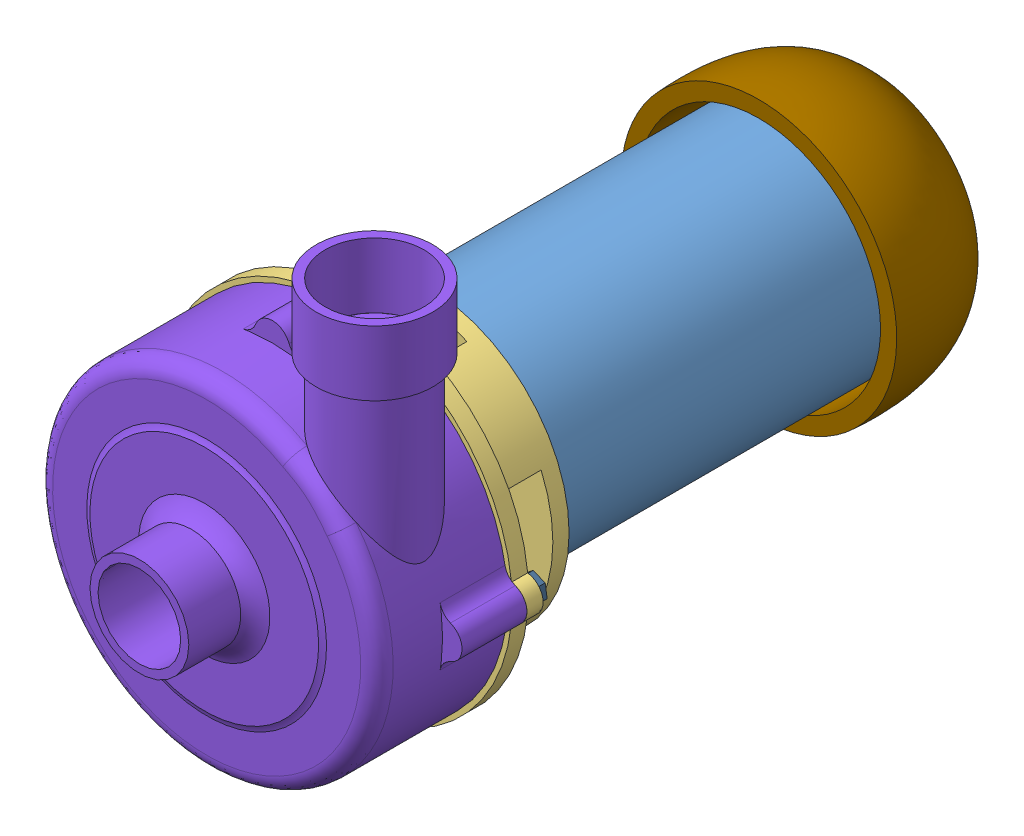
SolidWorks assembly bomba 3hp.SLDASM, configuration Predeterminado (file format 4400). Lengths in mm.
Overall size (242.78 296.39 452).
19 component instances, 10 part files, 38 mates.
Components (placement in the parent):
- carcasa motor-1: carcasa motor.SLDPRT [Predeterminado] at (-5.8582 -4.6667 -110) size (140 140 220)
- rodete-1: rodete.SLDPRT [Predeterminado] at (-5.8582 -4.6667 220) x (-0.923728 -0.383049 0) z (0 0 -1) size (153 153 60)
- plato sello-1: plato sello.SLDPRT [Predeterminado] at (-5.8582 -4.6667 165) x (-1 0 0) z (0 0 -1) size (234 234 65)
- sello mecanico tipo 6 15.5dia int-1: sello mecanico tipo 6 15.5dia int.SLDPRT [Predeterminado] at (-5.8582 -4.6667 175) x (-0.923728 -0.383049 0) z (0 0 -1) size (25 25 5)
- sello mecanico tipo 6 15.5dia int-2: sello mecanico tipo 6 15.5dia int.SLDPRT [Predeterminado] at (-5.8582 -4.6667 170) x (-0.923728 -0.383049 0) z (0 0 -1) size (25 25 5)
- sello mecanico tipo 6 15.5dia int-3: sello mecanico tipo 6 15.5dia int.SLDPRT [Predeterminado] at (-5.8582 -4.6667 165) x (-0.923728 -0.383049 0) z (0 0 -1) size (25 25 5)
- sello mecanico tipo 6 15.5dia int-4: sello mecanico tipo 6 15.5dia int.SLDPRT [Predeterminado] at (-5.8582 -4.6667 160) x (-0.923728 -0.383049 0) z (0 0 -1) size (25 25 5)
- eje-1: eje.SLDPRT [Predeterminado] at (-5.8582 -4.6667 165) x (-0.920527 -0.390678 0) z (0 0 -1) size (35 35 180)
- tuerca-1: tuerca.SLDPRT [Predeterminado] at (-5.8582 -4.6667 195) x (-0.923728 -0.383049 0) z (0 0 -1) size (21.65 25 8)
- tornillo motor-1: tornillo motor.SLDPRT [Predeterminado] at (52.1418 -4.6667 125) x (-0.99139 -0.13094 0) z (0 0 -1) size (13.25 14.99 30)
- tornillo motor-2: tornillo motor.SLDPRT [Predeterminado] at (-5.8582 53.3333 125) x (-0.750369 -0.661019 0) z (0 0 -1) size (13.25 14.99 30)
- tornillo motor-3: tornillo motor.SLDPRT [Predeterminado] at (-5.8582 -62.6667 125) x (-0.984805 -0.173666 0) z (0 0 -1) size (13.25 14.99 30)
- tornillo motor-4: tornillo motor.SLDPRT [Predeterminado] at (-63.8582 -4.6667 125) x (-0.122819 -0.992429 0) z (0 0 -1) size (13.25 14.99 30)
- carcasa-1: carcasa.SLDPRT [Predeterminado] at (-5.8582 -4.6667 247) x (-1 0 0) z (0 0 -1) size (234 292 122)
- tapa carcasa motor-1: tapa carcasa motor.SLDPRT [Predeterminado] at (-5.8582 -4.6667 -95) x (0.601508 -0.798867 0) z (0.798867 0.601508 0) size (173.37 70 173.37)
- tornillo carcasa de media-1: tornillo carcasa de media.SLDPRT [Predeterminado] at (-111.8582 -4.6667 155) size (14.9 15.82 31)
- tornillo carcasa de media-12: tornillo carcasa de media.SLDPRT [Predeterminado] at (100.1418 -4.6667 155) size (14.9 15.82 31)
- tornillo carcasa de media-13: tornillo carcasa de media.SLDPRT [Predeterminado] at (-5.8582 101.3333 155) size (14.9 15.82 31)
- tornillo carcasa de media-14: tornillo carcasa de media.SLDPRT [Predeterminado] at (-5.8582 -110.6667 155) size (14.9 15.82 31)
Mates (geometry in assembly coordinates):
- Concéntrica1: concentric aligned: cylinder of sello mecanico tipo 6 15.5dia int-2 through (-5.8582 -4.6667 165) axis (0 0 1) radius 7.75; cylinder of sello mecanico tipo 6 15.5dia int-3 through (-5.8582 -4.6667 160) axis (0 0 1) radius 7.75
- Concéntrica2: concentric aligned: cylinder of sello mecanico tipo 6 15.5dia int-2 through (-5.8582 -4.6667 165) axis (0 0 1) radius 7.75; cylinder of sello mecanico tipo 6 15.5dia int-4 through (-5.8582 -4.6667 155) axis (0 0 1) radius 7.75
- Concéntrica3: concentric aligned: cylinder of sello mecanico tipo 6 15.5dia int-2 through (-5.8582 -4.6667 165) axis (0 0 1) radius 7.75; cylinder of sello mecanico tipo 6 15.5dia int-1 through (-5.8582 -4.6667 170) axis (0 0 1) radius 7.75
- Concéntrica4: concentric anti-aligned: cylinder of sello mecanico tipo 6 15.5dia int-2 through (-5.8582 -4.6667 165) axis (0 0 1) radius 7.75; cylinder of plato sello-1 through (-5.8582 -4.6667 170) axis (0 0 -1) radius 12.5
- Coincidente1: coincident anti-aligned: plane of sello mecanico tipo 6 15.5dia int-3 through (-5.8582 -4.6667 160) normal (0 0 -1); plane of sello mecanico tipo 6 15.5dia int-4 through (-5.8582 -4.6667 160) normal (0 0 1)
- Coincidente2: coincident anti-aligned: plane of sello mecanico tipo 6 15.5dia int-2 through (-5.8582 -4.6667 165) normal (0 0 -1); plane of sello mecanico tipo 6 15.5dia int-3 through (-5.8582 -4.6667 165) normal (0 0 1)
- Coincidente3: coincident anti-aligned: plane of sello mecanico tipo 6 15.5dia int-1 through (-5.8582 -4.6667 170) normal (0 0 -1); plane of sello mecanico tipo 6 15.5dia int-2 through (-5.8582 -4.6667 170) normal (0 0 1)
- Coincidente4: coincident anti-aligned: circle of plato sello-1; plane of sello mecanico tipo 6 15.5dia int-4 through (-5.8582 -4.6667 155) normal (0 0 -1)
- Concéntrica5: concentric anti-aligned: cylinder of sello mecanico tipo 6 15.5dia int-1 through (-5.8582 -4.6667 170) axis (0 0 1) radius 7.75; cylinder of eje-1 through (-5.8582 -4.6667 195) axis (0 0 -1) radius 7.5
- Concéntrica6: concentric aligned: cylinder of rodete-1 through (-5.8582 -4.6667 235.001) axis (0 0 -1) radius 7.5; cylinder of eje-1 through (-5.8582 -4.6667 195) axis (0 0 -1) radius 7.5
- Distancia2: distance = 20 mm aligned: plane of eje-1 through (-5.8582 -4.6667 195) normal (0 0 1); plane of sello mecanico tipo 6 15.5dia int-1 through (-5.8582 -4.6667 175) normal (0 0 1)
- Coincidente7: coincident anti-aligned: plane of rodete-1 through (-5.8582 -4.6667 175) normal (0 0 -1); plane of sello mecanico tipo 6 15.5dia int-1 through (-5.8582 -4.6667 175) normal (0 0 1)
- Concéntrica7: concentric anti-aligned: cylinder of eje-1 through (-5.8582 -4.6667 195) axis (0 0 -1) radius 7.5; cylinder of tuerca-1 through (-5.8582 -4.6667 187) axis (0 0 1) radius 7.5
- Coincidente9: coincident aligned: plane of eje-1 through (-5.8582 -4.6667 195) normal (0 0 1); plane of tuerca-1 through (-10.6464 6.8799 195) normal (0 0 1)
- Concéntrica8: concentric anti-aligned: cylinder of carcasa motor-1 through (-5.8582 -4.6667 -110.001) axis (0 0 1) radius 17.5; cylinder of eje-1 through (-5.8582 -4.6667 135) axis (0 0 -1) radius 17.5
- Concéntrica9: concentric anti-aligned: cylinder of carcasa motor-1 through (-63.8582 -4.6667 -110.001) axis (0 0 1) radius 5; cylinder of plato sello-1 through (-63.8582 -4.6667 120) axis (0 0 -1) radius 5
- Concéntrica10: concentric aligned: cylinder of carcasa motor-1 through (-5.8582 -62.6667 -110.001) axis (0 0 1) radius 5; cylinder of tornillo motor-3 through (-5.8582 -62.6667 95) axis (0 0 1) radius 5
- Concéntrica11: concentric aligned: cylinder of carcasa motor-1 through (52.1418 -4.6667 -110.001) axis (0 0 1) radius 5; cylinder of tornillo motor-1 through (52.1418 -4.6667 95) axis (0 0 1) radius 5
- Concéntrica12: concentric aligned: cylinder of carcasa motor-1 through (-63.8582 -4.6667 -110.001) axis (0 0 1) radius 5; cylinder of tornillo motor-4 through (-63.8582 -4.6667 95) axis (0 0 1) radius 5
- Concéntrica13: concentric aligned: cylinder of carcasa motor-1 through (-5.8582 53.3333 -110.001) axis (0 0 1) radius 5; cylinder of tornillo motor-2 through (-5.8582 53.3333 95) axis (0 0 1) radius 5
- Coincidente11: coincident anti-aligned: plane of plato sello-1 through (29.1418 -121.6677 120) normal (0 0 1); plane of tornillo motor-4 through (-71.3292 -4.0077 120) normal (0 0 -1)
- Coincidente12: coincident anti-aligned: plane of plato sello-1 through (29.1418 -121.6677 120) normal (0 0 1); plane of tornillo motor-3 through (-7.4194 -55.331 120) normal (0 0 -1)
- Coincidente13: coincident anti-aligned: plane of plato sello-1 through (29.1418 -121.6677 120) normal (0 0 1); plane of tornillo motor-2 through (-11.0106 58.7834 120) normal (0 0 -1)
- Coincidente14: coincident anti-aligned: plane of plato sello-1 through (29.1418 -121.6677 120) normal (0 0 1); plane of tornillo motor-1 through (50.8991 2.7296 120) normal (0 0 -1)
- Coincidente15: coincident anti-aligned: plane of carcasa motor-1 through (-5.8582 -4.6667 110) normal (0 0 1); plane of plato sello-1 through (-5.8582 -4.6667 110) normal (0 0 -1)
- Concéntrica14: concentric aligned: cylinder of plato sello-1 through (-5.8582 -4.6667 175) axis (0 0 -1) radius 92.5; cylinder of carcasa-1 through (-5.8582 -4.6667 245) axis (0 0 -1) radius 92.5
- Concéntrica15: concentric anti-aligned: cylinder of plato sello-1 through (100.1418 -4.6667 109.999) axis (0 0 1) radius 6.25; cylinder of carcasa-1 through (100.1418 -4.6667 195) axis (0 0 -1) radius 6.25
- Coincidente16: coincident anti-aligned: plane of plato sello-1 through (-5.8582 -4.6667 165) normal (0 0 1); plane of carcasa-1 through (-5.8582 -4.6667 165) normal (0 0 -1)
- Concéntrica16: concentric anti-aligned: circle of carcasa motor-1; circle of tapa carcasa motor-1
- Distancia4: distance = 15 mm anti-aligned: plane of carcasa motor-1 through (-5.8582 -4.6667 -110) normal (0 0 -1); plane of tapa carcasa motor-1 through (-56.9864 63.237 -95) normal (0 0 1)
- Concéntrica17: concentric anti-aligned: cylinder of plato sello-1 through (-111.8582 -4.6667 109.999) axis (0 0 1) radius 6.25; cylinder of tornillo carcasa de media-1 through (-111.8582 -4.6667 180) axis (0 0 -1) radius 6.25
- Coincidente17: coincident anti-aligned: plane of plato sello-1 through (102.1418 -4.6667 155) normal (0 0 -1); plane of tornillo carcasa de media-1 through (-113.0584 3.2427 155) normal (0 0 1)
- Concéntrica18: concentric: cylinder of plato sello-1 through (-5.8582 101.3333 109.999) axis (0 0 1) radius 6.25; cylinder of tornillo carcasa de media-13 through (-5.8582 101.3333 180) axis (0 0 -1) radius 6.25
- Coincidente18: coincident anti-aligned: plane of plato sello-1 through (102.1418 -4.6667 155) normal (0 0 -1); plane of tornillo carcasa de media-13 through (-7.0584 109.2427 155) normal (0 0 1)
- Concéntrica19: concentric: cylinder of plato sello-1 through (-5.8582 -110.6667 109.999) axis (0 0 1) radius 6.25; cylinder of tornillo carcasa de media-14 through (-5.8582 -110.6667 180) axis (0 0 -1) radius 6.25
- Coincidente19: coincident anti-aligned: plane of plato sello-1 through (102.1418 -4.6667 155) normal (0 0 -1); plane of tornillo carcasa de media-14 through (-7.0584 -102.7573 155) normal (0 0 1)
- Concéntrica20: concentric: cylinder of plato sello-1 through (100.1418 -4.6667 109.999) axis (0 0 1) radius 6.25; cylinder of tornillo carcasa de media-12 through (100.1418 -4.6667 180) axis (0 0 -1) radius 6.25
- Coincidente20: coincident anti-aligned: plane of plato sello-1 through (102.1418 -4.6667 155) normal (0 0 -1); plane of tornillo carcasa de media-12 through (98.9416 3.2427 155) normal (0 0 1)
